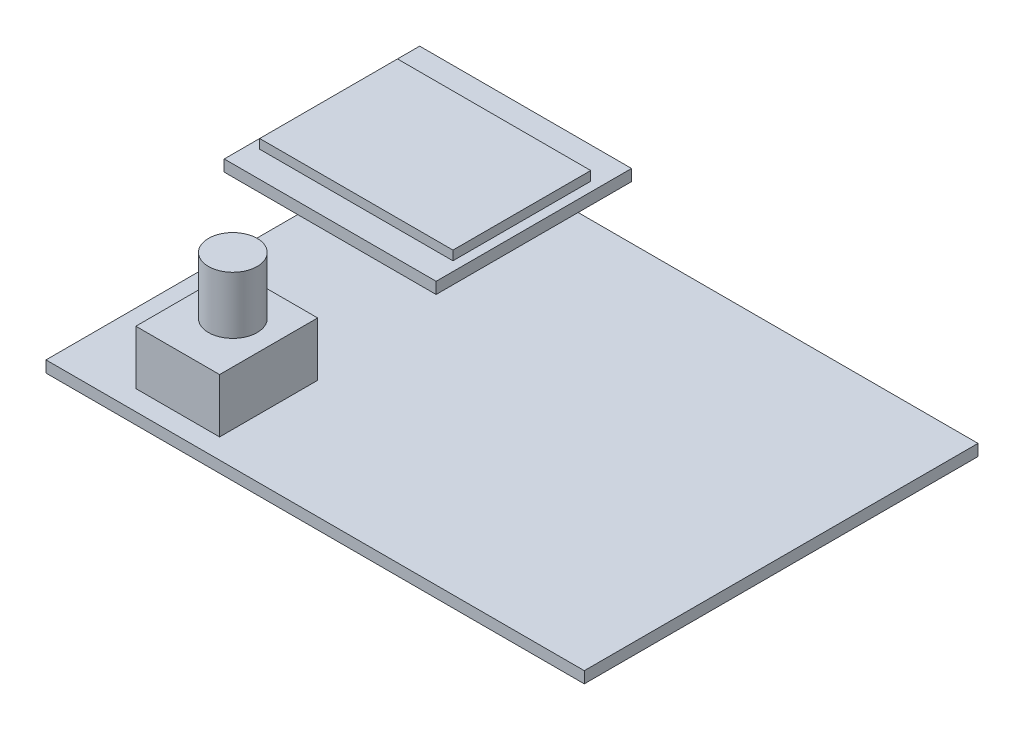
ISO-10303-21;
HEADER;
FILE_DESCRIPTION(('STEP AP214'),'2;1');
FILE_NAME('part.step','',(''),(''),'','','');
FILE_SCHEMA(('AUTOMOTIVE_DESIGN { 1 0 10303 214 1 1 1 1 }'));
ENDSEC;
DATA;
#1=APPLICATION_CONTEXT('core data for automotive mechanical design processes');
#2=APPLICATION_PROTOCOL_DEFINITION('international standard','automotive_design',2000,#1);
#3=PRODUCT_CONTEXT('',#1,'mechanical');
#4=PRODUCT('Part','Part','',(#3));
#5=PRODUCT_RELATED_PRODUCT_CATEGORY('part','',(#4));
#6=PRODUCT_DEFINITION_FORMATION('','',#4);
#7=PRODUCT_DEFINITION_CONTEXT('part definition',#1,'design');
#8=PRODUCT_DEFINITION('design','',#6,#7);
#9=PRODUCT_DEFINITION_SHAPE('','',#8);
#10=(LENGTH_UNIT() NAMED_UNIT(*) SI_UNIT(.MILLI.,.METRE.));
#11=(NAMED_UNIT(*) PLANE_ANGLE_UNIT() SI_UNIT($,.RADIAN.));
#12=(NAMED_UNIT(*) SI_UNIT($,.STERADIAN.) SOLID_ANGLE_UNIT());
#13=UNCERTAINTY_MEASURE_WITH_UNIT(LENGTH_MEASURE(1.E-05),#10,'distance_accuracy_value','');
#14=(GEOMETRIC_REPRESENTATION_CONTEXT(3) GLOBAL_UNCERTAINTY_ASSIGNED_CONTEXT((#13)) GLOBAL_UNIT_ASSIGNED_CONTEXT((#10,
#11,#12)) REPRESENTATION_CONTEXT('',''));
#15=CARTESIAN_POINT('',(0.,0.,0.));
#16=DIRECTION('',(0.,0.,1.));
#17=DIRECTION('',(1.,0.,0.));
#18=AXIS2_PLACEMENT_3D('',#15,#16,#17);
#19=CARTESIAN_POINT('',(-14.25,53.66,-22.75));
#20=DIRECTION('',(-1.,0.,0.));
#21=DIRECTION('',(0.,0.,1.));
#22=AXIS2_PLACEMENT_3D('',#19,#20,#21);
#23=PLANE('',#22);
#24=DIRECTION('',(0.,0.,-1.));
#25=VECTOR('',#24,1.);
#26=CARTESIAN_POINT('',(-14.25,52.06,-22.75));
#27=LINE('',#26,#25);
#28=CARTESIAN_POINT('',(-14.25,52.06,4.54999999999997));
#29=VERTEX_POINT('',#28);
#30=CARTESIAN_POINT('',(-14.25,52.06,-22.75));
#31=VERTEX_POINT('',#30);
#32=EDGE_CURVE('E133',#29,#31,#27,.T.);
#33=ORIENTED_EDGE('',*,*,#32,.T.);
#34=DIRECTION('',(0.,-1.,0.));
#35=VECTOR('',#34,1.);
#36=CARTESIAN_POINT('',(-14.25,53.66,-22.75));
#37=LINE('',#36,#35);
#38=CARTESIAN_POINT('',(-14.25,53.66,-22.75));
#39=VERTEX_POINT('',#38);
#40=EDGE_CURVE('E12',#39,#31,#37,.T.);
#41=ORIENTED_EDGE('',*,*,#40,.F.);
#42=DIRECTION('',(0.,0.,-1.));
#43=VECTOR('',#42,1.);
#44=CARTESIAN_POINT('',(-14.25,53.66,-22.75));
#45=LINE('',#44,#43);
#46=CARTESIAN_POINT('',(-14.25,53.66,4.54999999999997));
#47=VERTEX_POINT('',#46);
#48=EDGE_CURVE('E154',#47,#39,#45,.T.);
#49=ORIENTED_EDGE('',*,*,#48,.F.);
#50=DIRECTION('',(0.,-1.,0.));
#51=VECTOR('',#50,1.);
#52=CARTESIAN_POINT('',(-14.25,53.66,4.54999999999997));
#53=LINE('',#52,#51);
#54=EDGE_CURVE('E160',#47,#29,#53,.T.);
#55=ORIENTED_EDGE('',*,*,#54,.T.);
#56=EDGE_LOOP('',(#33,#41,#49,#55));
#57=FACE_BOUND('',#56,.T.);
#58=ADVANCED_FACE('F42',(#57),#23,.F.);
#59=CARTESIAN_POINT('',(-43.85,53.66,-22.75));
#60=DIRECTION('',(0.,0.,1.));
#61=DIRECTION('',(0.,-1.,0.));
#62=AXIS2_PLACEMENT_3D('',#59,#60,#61);
#63=PLANE('',#62);
#64=DIRECTION('',(-1.,0.,0.));
#65=VECTOR('',#64,1.);
#66=CARTESIAN_POINT('',(-43.85,52.06,-22.75));
#67=LINE('',#66,#65);
#68=CARTESIAN_POINT('',(-43.85,52.06,-22.75));
#69=VERTEX_POINT('',#68);
#70=EDGE_CURVE('E163',#31,#69,#67,.T.);
#71=ORIENTED_EDGE('',*,*,#70,.T.);
#72=DIRECTION('',(0.,-1.,0.));
#73=VECTOR('',#72,1.);
#74=CARTESIAN_POINT('',(-43.85,53.66,-22.75));
#75=LINE('',#74,#73);
#76=CARTESIAN_POINT('',(-43.85,53.66,-22.75));
#77=VERTEX_POINT('',#76);
#78=EDGE_CURVE('E49',#77,#69,#75,.T.);
#79=ORIENTED_EDGE('',*,*,#78,.F.);
#80=DIRECTION('',(-1.,0.,0.));
#81=VECTOR('',#80,1.);
#82=CARTESIAN_POINT('',(-43.85,53.66,-22.75));
#83=LINE('',#82,#81);
#84=EDGE_CURVE('E93',#39,#77,#83,.T.);
#85=ORIENTED_EDGE('',*,*,#84,.F.);
#86=ORIENTED_EDGE('',*,*,#40,.T.);
#87=EDGE_LOOP('',(#71,#79,#85,#86));
#88=FACE_BOUND('',#87,.T.);
#89=ADVANCED_FACE('F192',(#88),#63,.F.);
#90=CARTESIAN_POINT('',(-43.85,53.66,-22.75));
#91=DIRECTION('',(1.,0.,0.));
#92=DIRECTION('',(0.,1.,0.));
#93=AXIS2_PLACEMENT_3D('',#90,#91,#92);
#94=PLANE('',#93);
#95=DIRECTION('',(0.,0.,1.));
#96=VECTOR('',#95,1.);
#97=CARTESIAN_POINT('',(-43.85,52.06,-22.75));
#98=LINE('',#97,#96);
#99=CARTESIAN_POINT('',(-43.85,52.06,4.54999999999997));
#100=VERTEX_POINT('',#99);
#101=EDGE_CURVE('E165',#69,#100,#98,.T.);
#102=ORIENTED_EDGE('',*,*,#101,.T.);
#103=DIRECTION('',(0.,-1.,0.));
#104=VECTOR('',#103,1.);
#105=CARTESIAN_POINT('',(-43.85,53.66,4.54999999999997));
#106=LINE('',#105,#104);
#107=CARTESIAN_POINT('',(-43.85,53.66,4.54999999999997));
#108=VERTEX_POINT('',#107);
#109=EDGE_CURVE('E169',#108,#100,#106,.T.);
#110=ORIENTED_EDGE('',*,*,#109,.F.);
#111=DIRECTION('',(0.,0.,1.));
#112=VECTOR('',#111,1.);
#113=CARTESIAN_POINT('',(-43.85,53.66,-22.75));
#114=LINE('',#113,#112);
#115=EDGE_CURVE('E157',#77,#108,#114,.T.);
#116=ORIENTED_EDGE('',*,*,#115,.F.);
#117=ORIENTED_EDGE('',*,*,#78,.T.);
#118=EDGE_LOOP('',(#102,#110,#116,#117));
#119=FACE_BOUND('',#118,.T.);
#120=ADVANCED_FACE('F174',(#119),#94,.F.);
#121=CARTESIAN_POINT('',(-43.85,53.66,4.54999999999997));
#122=DIRECTION('',(0.,0.,-1.));
#123=DIRECTION('',(0.,1.,0.));
#124=AXIS2_PLACEMENT_3D('',#121,#122,#123);
#125=PLANE('',#124);
#126=DIRECTION('',(1.,0.,0.));
#127=VECTOR('',#126,1.);
#128=CARTESIAN_POINT('',(-43.85,52.06,4.54999999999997));
#129=LINE('',#128,#127);
#130=EDGE_CURVE('E86',#100,#29,#129,.T.);
#131=ORIENTED_EDGE('',*,*,#130,.T.);
#132=ORIENTED_EDGE('',*,*,#54,.F.);
#133=DIRECTION('',(1.,0.,0.));
#134=VECTOR('',#133,1.);
#135=CARTESIAN_POINT('',(-43.85,53.66,4.54999999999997));
#136=LINE('',#135,#134);
#137=EDGE_CURVE('E65',#108,#47,#136,.T.);
#138=ORIENTED_EDGE('',*,*,#137,.F.);
#139=ORIENTED_EDGE('',*,*,#109,.T.);
#140=EDGE_LOOP('',(#131,#132,#138,#139));
#141=FACE_BOUND('',#140,.T.);
#142=ADVANCED_FACE('F182',(#141),#125,.F.);
#143=CARTESIAN_POINT('',(0.,53.66,0.));
#144=DIRECTION('',(0.,1.,0.));
#145=DIRECTION('',(0.,0.,1.));
#146=AXIS2_PLACEMENT_3D('',#143,#144,#145);
#147=PLANE('',#146);
#148=DIRECTION('',(1.,0.,0.));
#149=VECTOR('',#148,1.);
#150=CARTESIAN_POINT('',(-42.55,53.66,0.89999999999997));
#151=LINE('',#150,#149);
#152=CARTESIAN_POINT('',(-42.55,53.66,0.89999999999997));
#153=VERTEX_POINT('',#152);
#154=CARTESIAN_POINT('',(-15.55,53.66,0.89999999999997));
#155=VERTEX_POINT('',#154);
#156=EDGE_CURVE('E56',#153,#155,#151,.T.);
#157=ORIENTED_EDGE('',*,*,#156,.F.);
#158=DIRECTION('',(0.,0.,1.));
#159=VECTOR('',#158,1.);
#160=CARTESIAN_POINT('',(-42.55,53.66,-18.35));
#161=LINE('',#160,#159);
#162=CARTESIAN_POINT('',(-42.55,53.66,-18.35));
#163=VERTEX_POINT('',#162);
#164=EDGE_CURVE('E126',#163,#153,#161,.T.);
#165=ORIENTED_EDGE('',*,*,#164,.F.);
#166=DIRECTION('',(1.,0.,0.));
#167=VECTOR('',#166,1.);
#168=CARTESIAN_POINT('',(-42.55,53.66,-18.35));
#169=LINE('',#168,#167);
#170=CARTESIAN_POINT('',(-15.55,53.66,-18.35));
#171=VERTEX_POINT('',#170);
#172=EDGE_CURVE('E146',#163,#171,#169,.T.);
#173=ORIENTED_EDGE('',*,*,#172,.T.);
#174=DIRECTION('',(0.,0.,1.));
#175=VECTOR('',#174,1.);
#176=CARTESIAN_POINT('',(-15.55,53.66,-18.35));
#177=LINE('',#176,#175);
#178=EDGE_CURVE('E144',#171,#155,#177,.T.);
#179=ORIENTED_EDGE('',*,*,#178,.T.);
#180=EDGE_LOOP('',(#157,#165,#173,#179));
#181=FACE_BOUND('',#180,.T.);
#182=ORIENTED_EDGE('',*,*,#48,.T.);
#183=ORIENTED_EDGE('',*,*,#84,.T.);
#184=ORIENTED_EDGE('',*,*,#115,.T.);
#185=ORIENTED_EDGE('',*,*,#137,.T.);
#186=EDGE_LOOP('',(#182,#183,#184,#185));
#187=FACE_BOUND('',#186,.T.);
#188=ADVANCED_FACE('F184',(#181,#187),#147,.T.);
#189=CARTESIAN_POINT('',(0.,52.06,0.));
#190=DIRECTION('',(0.,1.,0.));
#191=DIRECTION('',(0.,0.,1.));
#192=AXIS2_PLACEMENT_3D('',#189,#190,#191);
#193=PLANE('',#192);
#194=ORIENTED_EDGE('',*,*,#32,.F.);
#195=ORIENTED_EDGE('',*,*,#130,.F.);
#196=ORIENTED_EDGE('',*,*,#101,.F.);
#197=ORIENTED_EDGE('',*,*,#70,.F.);
#198=EDGE_LOOP('',(#194,#195,#196,#197));
#199=FACE_BOUND('',#198,.T.);
#200=ADVANCED_FACE('F178',(#199),#193,.F.);
#201=CARTESIAN_POINT('',(-42.55,54.96,0.89999999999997));
#202=DIRECTION('',(0.,0.,-1.));
#203=DIRECTION('',(-1.,0.,0.));
#204=AXIS2_PLACEMENT_3D('',#201,#202,#203);
#205=PLANE('',#204);
#206=ORIENTED_EDGE('',*,*,#156,.T.);
#207=DIRECTION('',(0.,-1.,0.));
#208=VECTOR('',#207,1.);
#209=CARTESIAN_POINT('',(-15.55,54.96,0.89999999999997));
#210=LINE('',#209,#208);
#211=CARTESIAN_POINT('',(-15.55,54.96,0.89999999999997));
#212=VERTEX_POINT('',#211);
#213=EDGE_CURVE('E128',#212,#155,#210,.T.);
#214=ORIENTED_EDGE('',*,*,#213,.F.);
#215=DIRECTION('',(1.,0.,0.));
#216=VECTOR('',#215,1.);
#217=CARTESIAN_POINT('',(-42.55,54.96,0.89999999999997));
#218=LINE('',#217,#216);
#219=CARTESIAN_POINT('',(-42.55,54.96,0.89999999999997));
#220=VERTEX_POINT('',#219);
#221=EDGE_CURVE('E117',#220,#212,#218,.T.);
#222=ORIENTED_EDGE('',*,*,#221,.F.);
#223=DIRECTION('',(0.,-1.,0.));
#224=VECTOR('',#223,1.);
#225=CARTESIAN_POINT('',(-42.55,54.96,0.89999999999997));
#226=LINE('',#225,#224);
#227=EDGE_CURVE('E142',#220,#153,#226,.T.);
#228=ORIENTED_EDGE('',*,*,#227,.T.);
#229=EDGE_LOOP('',(#206,#214,#222,#228));
#230=FACE_BOUND('',#229,.T.);
#231=ADVANCED_FACE('F129',(#230),#205,.F.);
#232=CARTESIAN_POINT('',(-15.55,54.96,-18.35));
#233=DIRECTION('',(1.,0.,0.));
#234=DIRECTION('',(0.,0.,-1.));
#235=AXIS2_PLACEMENT_3D('',#232,#233,#234);
#236=PLANE('',#235);
#237=ORIENTED_EDGE('',*,*,#178,.F.);
#238=DIRECTION('',(0.,-1.,0.));
#239=VECTOR('',#238,1.);
#240=CARTESIAN_POINT('',(-15.55,54.96,-18.35));
#241=LINE('',#240,#239);
#242=CARTESIAN_POINT('',(-15.55,54.96,-18.35));
#243=VERTEX_POINT('',#242);
#244=EDGE_CURVE('E134',#243,#171,#241,.T.);
#245=ORIENTED_EDGE('',*,*,#244,.F.);
#246=DIRECTION('',(0.,0.,1.));
#247=VECTOR('',#246,1.);
#248=CARTESIAN_POINT('',(-15.55,54.96,-18.35));
#249=LINE('',#248,#247);
#250=EDGE_CURVE('E121',#243,#212,#249,.T.);
#251=ORIENTED_EDGE('',*,*,#250,.T.);
#252=ORIENTED_EDGE('',*,*,#213,.T.);
#253=EDGE_LOOP('',(#237,#245,#251,#252));
#254=FACE_BOUND('',#253,.T.);
#255=ADVANCED_FACE('F136',(#254),#236,.T.);
#256=CARTESIAN_POINT('',(-42.55,54.96,-18.35));
#257=DIRECTION('',(0.,0.,-1.));
#258=DIRECTION('',(-1.,0.,0.));
#259=AXIS2_PLACEMENT_3D('',#256,#257,#258);
#260=PLANE('',#259);
#261=ORIENTED_EDGE('',*,*,#172,.F.);
#262=DIRECTION('',(0.,-1.,0.));
#263=VECTOR('',#262,1.);
#264=CARTESIAN_POINT('',(-42.55,54.96,-18.35));
#265=LINE('',#264,#263);
#266=CARTESIAN_POINT('',(-42.55,54.96,-18.35));
#267=VERTEX_POINT('',#266);
#268=EDGE_CURVE('E151',#267,#163,#265,.T.);
#269=ORIENTED_EDGE('',*,*,#268,.F.);
#270=DIRECTION('',(1.,0.,0.));
#271=VECTOR('',#270,1.);
#272=CARTESIAN_POINT('',(-42.55,54.96,-18.35));
#273=LINE('',#272,#271);
#274=EDGE_CURVE('E137',#267,#243,#273,.T.);
#275=ORIENTED_EDGE('',*,*,#274,.T.);
#276=ORIENTED_EDGE('',*,*,#244,.T.);
#277=EDGE_LOOP('',(#261,#269,#275,#276));
#278=FACE_BOUND('',#277,.T.);
#279=ADVANCED_FACE('F239',(#278),#260,.T.);
#280=CARTESIAN_POINT('',(-42.55,54.96,-18.35));
#281=DIRECTION('',(1.,0.,0.));
#282=DIRECTION('',(0.,0.,-1.));
#283=AXIS2_PLACEMENT_3D('',#280,#281,#282);
#284=PLANE('',#283);
#285=ORIENTED_EDGE('',*,*,#164,.T.);
#286=ORIENTED_EDGE('',*,*,#227,.F.);
#287=DIRECTION('',(0.,0.,1.));
#288=VECTOR('',#287,1.);
#289=CARTESIAN_POINT('',(-42.55,54.96,-18.35));
#290=LINE('',#289,#288);
#291=EDGE_CURVE('E124',#267,#220,#290,.T.);
#292=ORIENTED_EDGE('',*,*,#291,.F.);
#293=ORIENTED_EDGE('',*,*,#268,.T.);
#294=EDGE_LOOP('',(#285,#286,#292,#293));
#295=FACE_BOUND('',#294,.T.);
#296=ADVANCED_FACE('F248',(#295),#284,.F.);
#297=CARTESIAN_POINT('',(0.,54.96,0.));
#298=DIRECTION('',(0.,-1.,0.));
#299=DIRECTION('',(0.,0.,-1.));
#300=AXIS2_PLACEMENT_3D('',#297,#298,#299);
#301=PLANE('',#300);
#302=ORIENTED_EDGE('',*,*,#221,.T.);
#303=ORIENTED_EDGE('',*,*,#250,.F.);
#304=ORIENTED_EDGE('',*,*,#274,.F.);
#305=ORIENTED_EDGE('',*,*,#291,.T.);
#306=EDGE_LOOP('',(#302,#303,#304,#305));
#307=FACE_BOUND('',#306,.T.);
#308=ADVANCED_FACE('F118',(#307),#301,.F.);
#309=CLOSED_SHELL('',(#58,#89,#120,#142,#188,#200,#231,#255,#279,#296,#308));
#310=MANIFOLD_SOLID_BREP('B2',#309);
#311=CARTESIAN_POINT('',(29.35,39.8,-27.55));
#312=DIRECTION('',(0.,-1.,0.));
#313=DIRECTION('',(0.,0.,-1.));
#314=AXIS2_PLACEMENT_3D('',#311,#312,#313);
#315=PLANE('',#314);
#316=DIRECTION('',(0.,0.,1.));
#317=VECTOR('',#316,1.);
#318=CARTESIAN_POINT('',(-45.85,39.8,-27.55));
#319=LINE('',#318,#317);
#320=CARTESIAN_POINT('',(-45.85,39.8,-27.55));
#321=VERTEX_POINT('',#320);
#322=CARTESIAN_POINT('',(-45.85,39.8,27.45));
#323=VERTEX_POINT('',#322);
#324=EDGE_CURVE('E381',#321,#323,#319,.T.);
#325=ORIENTED_EDGE('',*,*,#324,.T.);
#326=DIRECTION('',(-1.,0.,0.));
#327=VECTOR('',#326,1.);
#328=CARTESIAN_POINT('',(29.35,39.8,27.45));
#329=LINE('',#328,#327);
#330=CARTESIAN_POINT('',(29.35,39.8,27.45));
#331=VERTEX_POINT('',#330);
#332=EDGE_CURVE('E395',#331,#323,#329,.T.);
#333=ORIENTED_EDGE('',*,*,#332,.F.);
#334=DIRECTION('',(0.,0.,1.));
#335=VECTOR('',#334,1.);
#336=CARTESIAN_POINT('',(29.35,39.8,-27.55));
#337=LINE('',#336,#335);
#338=CARTESIAN_POINT('',(29.35,39.8,-27.55));
#339=VERTEX_POINT('',#338);
#340=EDGE_CURVE('E386',#339,#331,#337,.T.);
#341=ORIENTED_EDGE('',*,*,#340,.F.);
#342=DIRECTION('',(-1.,0.,0.));
#343=VECTOR('',#342,1.);
#344=CARTESIAN_POINT('',(29.35,39.8,-27.55));
#345=LINE('',#344,#343);
#346=EDGE_CURVE('E289',#339,#321,#345,.T.);
#347=ORIENTED_EDGE('',*,*,#346,.T.);
#348=EDGE_LOOP('',(#325,#333,#341,#347));
#349=FACE_BOUND('',#348,.T.);
#350=DIRECTION('',(0.,0.,-1.));
#351=VECTOR('',#350,1.);
#352=CARTESIAN_POINT('',(-24.4,39.8,10.95));
#353=LINE('',#352,#351);
#354=CARTESIAN_POINT('',(-24.4,39.8,24.65));
#355=VERTEX_POINT('',#354);
#356=CARTESIAN_POINT('',(-24.4,39.8,10.95));
#357=VERTEX_POINT('',#356);
#358=EDGE_CURVE('E367',#355,#357,#353,.T.);
#359=ORIENTED_EDGE('',*,*,#358,.F.);
#360=DIRECTION('',(1.,0.,0.));
#361=VECTOR('',#360,1.);
#362=CARTESIAN_POINT('',(-36.1,39.8,24.65));
#363=LINE('',#362,#361);
#364=CARTESIAN_POINT('',(-36.1,39.8,24.65));
#365=VERTEX_POINT('',#364);
#366=EDGE_CURVE('E364',#365,#355,#363,.T.);
#367=ORIENTED_EDGE('',*,*,#366,.F.);
#368=DIRECTION('',(0.,0.,1.));
#369=VECTOR('',#368,1.);
#370=CARTESIAN_POINT('',(-36.1,39.8,10.95));
#371=LINE('',#370,#369);
#372=CARTESIAN_POINT('',(-36.1,39.8,10.95));
#373=VERTEX_POINT('',#372);
#374=EDGE_CURVE('E302',#373,#365,#371,.T.);
#375=ORIENTED_EDGE('',*,*,#374,.F.);
#376=DIRECTION('',(-1.,0.,0.));
#377=VECTOR('',#376,1.);
#378=CARTESIAN_POINT('',(-36.1,39.8,10.95));
#379=LINE('',#378,#377);
#380=EDGE_CURVE('E297',#357,#373,#379,.T.);
#381=ORIENTED_EDGE('',*,*,#380,.F.);
#382=EDGE_LOOP('',(#359,#367,#375,#381));
#383=FACE_BOUND('',#382,.T.);
#384=ADVANCED_FACE('F280',(#349,#383),#315,.F.);
#385=CARTESIAN_POINT('',(29.35,39.8,-27.55));
#386=DIRECTION('',(0.,0.,-1.));
#387=DIRECTION('',(-1.,0.,0.));
#388=AXIS2_PLACEMENT_3D('',#385,#386,#387);
#389=PLANE('',#388);
#390=DIRECTION('',(0.,-1.,0.));
#391=VECTOR('',#390,1.);
#392=CARTESIAN_POINT('',(-45.85,39.8,-27.55));
#393=LINE('',#392,#391);
#394=CARTESIAN_POINT('',(-45.85,38.2,-27.55));
#395=VERTEX_POINT('',#394);
#396=EDGE_CURVE('E368',#321,#395,#393,.T.);
#397=ORIENTED_EDGE('',*,*,#396,.F.);
#398=ORIENTED_EDGE('',*,*,#346,.F.);
#399=DIRECTION('',(0.,-1.,0.));
#400=VECTOR('',#399,1.);
#401=CARTESIAN_POINT('',(29.35,39.8,-27.55));
#402=LINE('',#401,#400);
#403=CARTESIAN_POINT('',(29.35,38.2,-27.55));
#404=VERTEX_POINT('',#403);
#405=EDGE_CURVE('E377',#339,#404,#402,.T.);
#406=ORIENTED_EDGE('',*,*,#405,.T.);
#407=DIRECTION('',(-1.,0.,0.));
#408=VECTOR('',#407,1.);
#409=CARTESIAN_POINT('',(29.35,38.2,-27.55));
#410=LINE('',#409,#408);
#411=EDGE_CURVE('E284',#404,#395,#410,.T.);
#412=ORIENTED_EDGE('',*,*,#411,.T.);
#413=EDGE_LOOP('',(#397,#398,#406,#412));
#414=FACE_BOUND('',#413,.T.);
#415=ADVANCED_FACE('F282',(#414),#389,.T.);
#416=CARTESIAN_POINT('',(29.35,39.8,27.45));
#417=DIRECTION('',(0.,0.,-1.));
#418=DIRECTION('',(-1.,0.,0.));
#419=AXIS2_PLACEMENT_3D('',#416,#417,#418);
#420=PLANE('',#419);
#421=DIRECTION('',(0.,-1.,0.));
#422=VECTOR('',#421,1.);
#423=CARTESIAN_POINT('',(-45.85,39.8,27.45));
#424=LINE('',#423,#422);
#425=CARTESIAN_POINT('',(-45.85,38.2,27.45));
#426=VERTEX_POINT('',#425);
#427=EDGE_CURVE('E390',#323,#426,#424,.T.);
#428=ORIENTED_EDGE('',*,*,#427,.T.);
#429=DIRECTION('',(-1.,0.,0.));
#430=VECTOR('',#429,1.);
#431=CARTESIAN_POINT('',(29.35,38.2,27.45));
#432=LINE('',#431,#430);
#433=CARTESIAN_POINT('',(29.35,38.2,27.45));
#434=VERTEX_POINT('',#433);
#435=EDGE_CURVE('E397',#434,#426,#432,.T.);
#436=ORIENTED_EDGE('',*,*,#435,.F.);
#437=DIRECTION('',(0.,-1.,0.));
#438=VECTOR('',#437,1.);
#439=CARTESIAN_POINT('',(29.35,39.8,27.45));
#440=LINE('',#439,#438);
#441=EDGE_CURVE('E384',#331,#434,#440,.T.);
#442=ORIENTED_EDGE('',*,*,#441,.F.);
#443=ORIENTED_EDGE('',*,*,#332,.T.);
#444=EDGE_LOOP('',(#428,#436,#442,#443));
#445=FACE_BOUND('',#444,.T.);
#446=ADVANCED_FACE('F415',(#445),#420,.F.);
#447=CARTESIAN_POINT('',(29.35,38.2,-27.55));
#448=DIRECTION('',(0.,-1.,0.));
#449=DIRECTION('',(0.,0.,-1.));
#450=AXIS2_PLACEMENT_3D('',#447,#448,#449);
#451=PLANE('',#450);
#452=DIRECTION('',(0.,0.,1.));
#453=VECTOR('',#452,1.);
#454=CARTESIAN_POINT('',(-45.85,38.2,-27.55));
#455=LINE('',#454,#453);
#456=EDGE_CURVE('E371',#395,#426,#455,.T.);
#457=ORIENTED_EDGE('',*,*,#456,.F.);
#458=ORIENTED_EDGE('',*,*,#411,.F.);
#459=DIRECTION('',(0.,0.,1.));
#460=VECTOR('',#459,1.);
#461=CARTESIAN_POINT('',(29.35,38.2,-27.55));
#462=LINE('',#461,#460);
#463=EDGE_CURVE('E380',#404,#434,#462,.T.);
#464=ORIENTED_EDGE('',*,*,#463,.T.);
#465=ORIENTED_EDGE('',*,*,#435,.T.);
#466=EDGE_LOOP('',(#457,#458,#464,#465));
#467=FACE_BOUND('',#466,.T.);
#468=ADVANCED_FACE('F405',(#467),#451,.T.);
#469=CARTESIAN_POINT('',(29.35,0.,0.));
#470=DIRECTION('',(-1.,0.,0.));
#471=DIRECTION('',(0.,0.,1.));
#472=AXIS2_PLACEMENT_3D('',#469,#470,#471);
#473=PLANE('',#472);
#474=ORIENTED_EDGE('',*,*,#405,.F.);
#475=ORIENTED_EDGE('',*,*,#340,.T.);
#476=ORIENTED_EDGE('',*,*,#441,.T.);
#477=ORIENTED_EDGE('',*,*,#463,.F.);
#478=EDGE_LOOP('',(#474,#475,#476,#477));
#479=FACE_BOUND('',#478,.T.);
#480=ADVANCED_FACE('F417',(#479),#473,.F.);
#481=CARTESIAN_POINT('',(-45.85,0.,0.));
#482=DIRECTION('',(-1.,0.,0.));
#483=DIRECTION('',(0.,0.,1.));
#484=AXIS2_PLACEMENT_3D('',#481,#482,#483);
#485=PLANE('',#484);
#486=ORIENTED_EDGE('',*,*,#396,.T.);
#487=ORIENTED_EDGE('',*,*,#456,.T.);
#488=ORIENTED_EDGE('',*,*,#427,.F.);
#489=ORIENTED_EDGE('',*,*,#324,.F.);
#490=EDGE_LOOP('',(#486,#487,#488,#489));
#491=FACE_BOUND('',#490,.T.);
#492=ADVANCED_FACE('F409',(#491),#485,.T.);
#493=CARTESIAN_POINT('',(-24.4,47.35,10.95));
#494=DIRECTION('',(-1.,0.,0.));
#495=DIRECTION('',(0.,0.,1.));
#496=AXIS2_PLACEMENT_3D('',#493,#494,#495);
#497=PLANE('',#496);
#498=ORIENTED_EDGE('',*,*,#358,.T.);
#499=DIRECTION('',(0.,-1.,0.));
#500=VECTOR('',#499,1.);
#501=CARTESIAN_POINT('',(-24.4,47.35,10.95));
#502=LINE('',#501,#500);
#503=CARTESIAN_POINT('',(-24.4,47.35,10.95));
#504=VERTEX_POINT('',#503);
#505=EDGE_CURVE('E348',#504,#357,#502,.T.);
#506=ORIENTED_EDGE('',*,*,#505,.F.);
#507=DIRECTION('',(0.,0.,-1.));
#508=VECTOR('',#507,1.);
#509=CARTESIAN_POINT('',(-24.4,47.35,10.95));
#510=LINE('',#509,#508);
#511=CARTESIAN_POINT('',(-24.4,47.35,24.65));
#512=VERTEX_POINT('',#511);
#513=EDGE_CURVE('E355',#512,#504,#510,.T.);
#514=ORIENTED_EDGE('',*,*,#513,.F.);
#515=DIRECTION('',(0.,-1.,0.));
#516=VECTOR('',#515,1.);
#517=CARTESIAN_POINT('',(-24.4,47.35,24.65));
#518=LINE('',#517,#516);
#519=EDGE_CURVE('E530',#512,#355,#518,.T.);
#520=ORIENTED_EDGE('',*,*,#519,.T.);
#521=EDGE_LOOP('',(#498,#506,#514,#520));
#522=FACE_BOUND('',#521,.T.);
#523=ADVANCED_FACE('F366',(#522),#497,.F.);
#524=CARTESIAN_POINT('',(-36.1,47.35,10.95));
#525=DIRECTION('',(0.,0.,1.));
#526=DIRECTION('',(0.,-1.,0.));
#527=AXIS2_PLACEMENT_3D('',#524,#525,#526);
#528=PLANE('',#527);
#529=ORIENTED_EDGE('',*,*,#380,.T.);
#530=DIRECTION('',(0.,-1.,0.));
#531=VECTOR('',#530,1.);
#532=CARTESIAN_POINT('',(-36.1,47.35,10.95));
#533=LINE('',#532,#531);
#534=CARTESIAN_POINT('',(-36.1,47.35,10.95));
#535=VERTEX_POINT('',#534);
#536=EDGE_CURVE('E351',#535,#373,#533,.T.);
#537=ORIENTED_EDGE('',*,*,#536,.F.);
#538=DIRECTION('',(-1.,0.,0.));
#539=VECTOR('',#538,1.);
#540=CARTESIAN_POINT('',(-36.1,47.35,10.95));
#541=LINE('',#540,#539);
#542=EDGE_CURVE('E344',#504,#535,#541,.T.);
#543=ORIENTED_EDGE('',*,*,#542,.F.);
#544=ORIENTED_EDGE('',*,*,#505,.T.);
#545=EDGE_LOOP('',(#529,#537,#543,#544));
#546=FACE_BOUND('',#545,.T.);
#547=ADVANCED_FACE('F346',(#546),#528,.F.);
#548=CARTESIAN_POINT('',(-36.1,47.35,10.95));
#549=DIRECTION('',(1.,0.,0.));
#550=DIRECTION('',(0.,1.,0.));
#551=AXIS2_PLACEMENT_3D('',#548,#549,#550);
#552=PLANE('',#551);
#553=ORIENTED_EDGE('',*,*,#374,.T.);
#554=DIRECTION('',(0.,-1.,0.));
#555=VECTOR('',#554,1.);
#556=CARTESIAN_POINT('',(-36.1,47.35,24.65));
#557=LINE('',#556,#555);
#558=CARTESIAN_POINT('',(-36.1,47.35,24.65));
#559=VERTEX_POINT('',#558);
#560=EDGE_CURVE('E373',#559,#365,#557,.T.);
#561=ORIENTED_EDGE('',*,*,#560,.F.);
#562=DIRECTION('',(0.,0.,1.));
#563=VECTOR('',#562,1.);
#564=CARTESIAN_POINT('',(-36.1,47.35,10.95));
#565=LINE('',#564,#563);
#566=EDGE_CURVE('E354',#535,#559,#565,.T.);
#567=ORIENTED_EDGE('',*,*,#566,.F.);
#568=ORIENTED_EDGE('',*,*,#536,.T.);
#569=EDGE_LOOP('',(#553,#561,#567,#568));
#570=FACE_BOUND('',#569,.T.);
#571=ADVANCED_FACE('F471',(#570),#552,.F.);
#572=CARTESIAN_POINT('',(-36.1,47.35,24.65));
#573=DIRECTION('',(0.,0.,-1.));
#574=DIRECTION('',(0.,1.,0.));
#575=AXIS2_PLACEMENT_3D('',#572,#573,#574);
#576=PLANE('',#575);
#577=ORIENTED_EDGE('',*,*,#366,.T.);
#578=ORIENTED_EDGE('',*,*,#519,.F.);
#579=DIRECTION('',(1.,0.,0.));
#580=VECTOR('',#579,1.);
#581=CARTESIAN_POINT('',(-36.1,47.35,24.65));
#582=LINE('',#581,#580);
#583=EDGE_CURVE('E360',#559,#512,#582,.T.);
#584=ORIENTED_EDGE('',*,*,#583,.F.);
#585=ORIENTED_EDGE('',*,*,#560,.T.);
#586=EDGE_LOOP('',(#577,#578,#584,#585));
#587=FACE_BOUND('',#586,.T.);
#588=ADVANCED_FACE('F480',(#587),#576,.F.);
#589=CARTESIAN_POINT('',(0.,47.35,0.));
#590=DIRECTION('',(0.,1.,0.));
#591=DIRECTION('',(0.,0.,1.));
#592=AXIS2_PLACEMENT_3D('',#589,#590,#591);
#593=PLANE('',#592);
#594=CARTESIAN_POINT('',(-30.25,47.35,16.95));
#595=DIRECTION('',(0.,1.,0.));
#596=DIRECTION('',(0.,0.,1.));
#597=AXIS2_PLACEMENT_3D('',#594,#595,#596);
#598=CIRCLE('',#597,3.4);
#599=CARTESIAN_POINT('',(-30.25,47.35,20.35));
#600=VERTEX_POINT('',#599);
#601=EDGE_CURVE('E40',#600,#600,#598,.T.);
#602=ORIENTED_EDGE('',*,*,#601,.F.);
#603=EDGE_LOOP('',(#602));
#604=FACE_BOUND('',#603,.T.);
#605=ORIENTED_EDGE('',*,*,#513,.T.);
#606=ORIENTED_EDGE('',*,*,#542,.T.);
#607=ORIENTED_EDGE('',*,*,#566,.T.);
#608=ORIENTED_EDGE('',*,*,#583,.T.);
#609=EDGE_LOOP('',(#605,#606,#607,#608));
#610=FACE_BOUND('',#609,.T.);
#611=ADVANCED_FACE('F358',(#604,#610),#593,.T.);
#612=CARTESIAN_POINT('',(-30.25,55.35,16.95));
#613=DIRECTION('',(0.,-1.,0.));
#614=DIRECTION('',(0.,0.,-1.));
#615=AXIS2_PLACEMENT_3D('',#612,#613,#614);
#616=CYLINDRICAL_SURFACE('',#615,3.4);
#617=CARTESIAN_POINT('',(-30.25,55.35,16.95));
#618=DIRECTION('',(0.,1.,0.));
#619=DIRECTION('',(0.,0.,1.));
#620=AXIS2_PLACEMENT_3D('',#617,#618,#619);
#621=CIRCLE('',#620,3.4);
#622=CARTESIAN_POINT('',(-30.25,55.35,20.35));
#623=VERTEX_POINT('',#622);
#624=EDGE_CURVE('E525',#623,#623,#621,.T.);
#625=ORIENTED_EDGE('',*,*,#624,.F.);
#626=EDGE_LOOP('',(#625));
#627=FACE_BOUND('',#626,.T.);
#628=ORIENTED_EDGE('',*,*,#601,.T.);
#629=EDGE_LOOP('',(#628));
#630=FACE_BOUND('',#629,.T.);
#631=ADVANCED_FACE('F499',(#627,#630),#616,.T.);
#632=CARTESIAN_POINT('',(-30.25,55.35,16.95));
#633=DIRECTION('',(0.,1.,0.));
#634=DIRECTION('',(0.,0.,1.));
#635=AXIS2_PLACEMENT_3D('',#632,#633,#634);
#636=PLANE('',#635);
#637=ORIENTED_EDGE('',*,*,#624,.T.);
#638=EDGE_LOOP('',(#637));
#639=FACE_BOUND('',#638,.T.);
#640=ADVANCED_FACE('F509',(#639),#636,.T.);
#641=CLOSED_SHELL('',(#384,#415,#446,#468,#480,#492,#523,#547,#571,#588,#611,#631,#640));
#642=MANIFOLD_SOLID_BREP('B6',#641);
#643=ADVANCED_BREP_SHAPE_REPRESENTATION('',(#18,#310,#642),#14);
#644=SHAPE_DEFINITION_REPRESENTATION(#9,#643);
ENDSEC;
END-ISO-10303-21;
